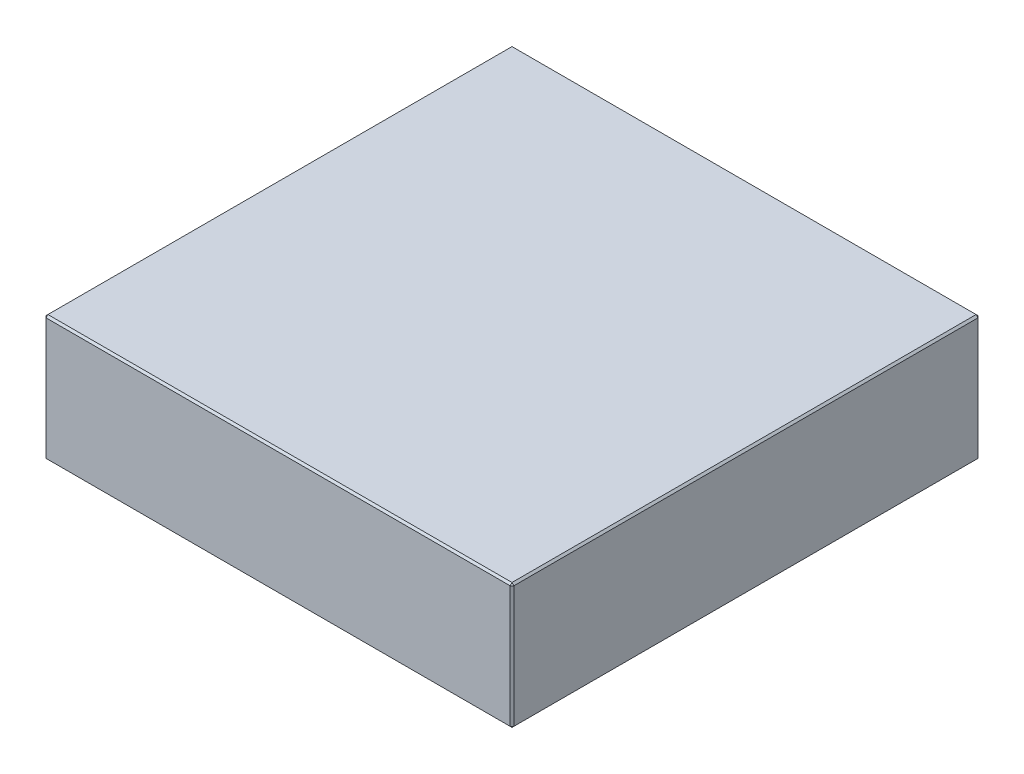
ISO-10303-21;
HEADER;
FILE_DESCRIPTION(('STEP AP214'),'2;1');
FILE_NAME('part.step','',(''),(''),'','','');
FILE_SCHEMA(('AUTOMOTIVE_DESIGN { 1 0 10303 214 1 1 1 1 }'));
ENDSEC;
DATA;
#1=APPLICATION_CONTEXT('core data for automotive mechanical design processes');
#2=APPLICATION_PROTOCOL_DEFINITION('international standard','automotive_design',2000,#1);
#3=PRODUCT_CONTEXT('',#1,'mechanical');
#4=PRODUCT('Part','Part','',(#3));
#5=PRODUCT_RELATED_PRODUCT_CATEGORY('part','',(#4));
#6=PRODUCT_DEFINITION_FORMATION('','',#4);
#7=PRODUCT_DEFINITION_CONTEXT('part definition',#1,'design');
#8=PRODUCT_DEFINITION('design','',#6,#7);
#9=PRODUCT_DEFINITION_SHAPE('','',#8);
#10=(LENGTH_UNIT() NAMED_UNIT(*) SI_UNIT(.MILLI.,.METRE.));
#11=(NAMED_UNIT(*) PLANE_ANGLE_UNIT() SI_UNIT($,.RADIAN.));
#12=(NAMED_UNIT(*) SI_UNIT($,.STERADIAN.) SOLID_ANGLE_UNIT());
#13=UNCERTAINTY_MEASURE_WITH_UNIT(LENGTH_MEASURE(1.E-05),#10,'distance_accuracy_value','');
#14=(GEOMETRIC_REPRESENTATION_CONTEXT(3) GLOBAL_UNCERTAINTY_ASSIGNED_CONTEXT((#13)) GLOBAL_UNIT_ASSIGNED_CONTEXT((#10,
#11,#12)) REPRESENTATION_CONTEXT('',''));
#15=CARTESIAN_POINT('',(0.,0.,0.));
#16=DIRECTION('',(0.,0.,1.));
#17=DIRECTION('',(1.,0.,0.));
#18=AXIS2_PLACEMENT_3D('',#15,#16,#17);
#19=CARTESIAN_POINT('',(-123.,66.,123.));
#20=DIRECTION('',(1.,0.,0.));
#21=DIRECTION('',(0.,0.,-1.));
#22=AXIS2_PLACEMENT_3D('',#19,#20,#21);
#23=PLANE('',#22);
#24=DIRECTION('',(0.,-1.,0.));
#25=VECTOR('',#24,1.);
#26=CARTESIAN_POINT('',(-123.,66.,-122.));
#27=LINE('',#26,#25);
#28=CARTESIAN_POINT('',(-123.,65.,-122.));
#29=VERTEX_POINT('',#28);
#30=CARTESIAN_POINT('',(-123.,1.,-122.));
#31=VERTEX_POINT('',#30);
#32=EDGE_CURVE('E115',#29,#31,#27,.T.);
#33=ORIENTED_EDGE('',*,*,#32,.T.);
#34=DIRECTION('',(0.,0.,1.));
#35=VECTOR('',#34,1.);
#36=CARTESIAN_POINT('',(-123.,1.,123.));
#37=LINE('',#36,#35);
#38=CARTESIAN_POINT('',(-123.,1.,122.));
#39=VERTEX_POINT('',#38);
#40=EDGE_CURVE('E111',#31,#39,#37,.T.);
#41=ORIENTED_EDGE('',*,*,#40,.T.);
#42=DIRECTION('',(0.,1.,0.));
#43=VECTOR('',#42,1.);
#44=CARTESIAN_POINT('',(-123.,66.,122.));
#45=LINE('',#44,#43);
#46=CARTESIAN_POINT('',(-123.,65.,122.));
#47=VERTEX_POINT('',#46);
#48=EDGE_CURVE('E104',#39,#47,#45,.T.);
#49=ORIENTED_EDGE('',*,*,#48,.T.);
#50=DIRECTION('',(0.,0.,-1.));
#51=VECTOR('',#50,1.);
#52=CARTESIAN_POINT('',(-123.,65.,-123.));
#53=LINE('',#52,#51);
#54=EDGE_CURVE('E108',#47,#29,#53,.T.);
#55=ORIENTED_EDGE('',*,*,#54,.T.);
#56=EDGE_LOOP('',(#33,#41,#49,#55));
#57=FACE_BOUND('',#56,.T.);
#58=ADVANCED_FACE('F16',(#57),#23,.F.);
#59=CARTESIAN_POINT('',(123.,66.,123.));
#60=DIRECTION('',(0.,0.,-1.));
#61=DIRECTION('',(-1.,0.,0.));
#62=AXIS2_PLACEMENT_3D('',#59,#60,#61);
#63=PLANE('',#62);
#64=DIRECTION('',(-1.,0.,0.));
#65=VECTOR('',#64,1.);
#66=CARTESIAN_POINT('',(-123.,65.,123.));
#67=LINE('',#66,#65);
#68=CARTESIAN_POINT('',(122.,65.,123.));
#69=VERTEX_POINT('',#68);
#70=CARTESIAN_POINT('',(-122.,65.,123.));
#71=VERTEX_POINT('',#70);
#72=EDGE_CURVE('E165',#69,#71,#67,.T.);
#73=ORIENTED_EDGE('',*,*,#72,.T.);
#74=DIRECTION('',(0.,-1.,0.));
#75=VECTOR('',#74,1.);
#76=CARTESIAN_POINT('',(-122.,66.,123.));
#77=LINE('',#76,#75);
#78=CARTESIAN_POINT('',(-122.,1.,123.));
#79=VERTEX_POINT('',#78);
#80=EDGE_CURVE('E123',#71,#79,#77,.T.);
#81=ORIENTED_EDGE('',*,*,#80,.T.);
#82=DIRECTION('',(1.,0.,0.));
#83=VECTOR('',#82,1.);
#84=CARTESIAN_POINT('',(123.,1.,123.));
#85=LINE('',#84,#83);
#86=CARTESIAN_POINT('',(122.,1.,123.));
#87=VERTEX_POINT('',#86);
#88=EDGE_CURVE('E169',#79,#87,#85,.T.);
#89=ORIENTED_EDGE('',*,*,#88,.T.);
#90=DIRECTION('',(0.,1.,0.));
#91=VECTOR('',#90,1.);
#92=CARTESIAN_POINT('',(122.,66.,123.));
#93=LINE('',#92,#91);
#94=EDGE_CURVE('E167',#87,#69,#93,.T.);
#95=ORIENTED_EDGE('',*,*,#94,.T.);
#96=EDGE_LOOP('',(#73,#81,#89,#95));
#97=FACE_BOUND('',#96,.T.);
#98=ADVANCED_FACE('F276',(#97),#63,.F.);
#99=CARTESIAN_POINT('',(123.,66.,123.));
#100=DIRECTION('',(-1.,0.,0.));
#101=DIRECTION('',(0.,0.,1.));
#102=AXIS2_PLACEMENT_3D('',#99,#100,#101);
#103=PLANE('',#102);
#104=DIRECTION('',(0.,0.,-1.));
#105=VECTOR('',#104,1.);
#106=CARTESIAN_POINT('',(123.,1.,123.));
#107=LINE('',#106,#105);
#108=CARTESIAN_POINT('',(123.,1.,122.));
#109=VERTEX_POINT('',#108);
#110=CARTESIAN_POINT('',(123.,1.,-122.));
#111=VERTEX_POINT('',#110);
#112=EDGE_CURVE('E160',#109,#111,#107,.T.);
#113=ORIENTED_EDGE('',*,*,#112,.T.);
#114=DIRECTION('',(0.,1.,0.));
#115=VECTOR('',#114,1.);
#116=CARTESIAN_POINT('',(123.,66.,-122.));
#117=LINE('',#116,#115);
#118=CARTESIAN_POINT('',(123.,65.,-122.));
#119=VERTEX_POINT('',#118);
#120=EDGE_CURVE('E162',#111,#119,#117,.T.);
#121=ORIENTED_EDGE('',*,*,#120,.T.);
#122=DIRECTION('',(0.,0.,1.));
#123=VECTOR('',#122,1.);
#124=CARTESIAN_POINT('',(123.,65.,123.));
#125=LINE('',#124,#123);
#126=CARTESIAN_POINT('',(123.,65.,122.));
#127=VERTEX_POINT('',#126);
#128=EDGE_CURVE('E156',#119,#127,#125,.T.);
#129=ORIENTED_EDGE('',*,*,#128,.T.);
#130=DIRECTION('',(0.,-1.,0.));
#131=VECTOR('',#130,1.);
#132=CARTESIAN_POINT('',(123.,66.,122.));
#133=LINE('',#132,#131);
#134=EDGE_CURVE('E158',#127,#109,#133,.T.);
#135=ORIENTED_EDGE('',*,*,#134,.T.);
#136=EDGE_LOOP('',(#113,#121,#129,#135));
#137=FACE_BOUND('',#136,.T.);
#138=ADVANCED_FACE('F255',(#137),#103,.F.);
#139=CARTESIAN_POINT('',(123.,66.,-123.));
#140=DIRECTION('',(0.,0.,1.));
#141=DIRECTION('',(1.,0.,0.));
#142=AXIS2_PLACEMENT_3D('',#139,#140,#141);
#143=PLANE('',#142);
#144=DIRECTION('',(0.,-1.,0.));
#145=VECTOR('',#144,1.);
#146=CARTESIAN_POINT('',(122.,66.,-123.));
#147=LINE('',#146,#145);
#148=CARTESIAN_POINT('',(122.,65.,-123.));
#149=VERTEX_POINT('',#148);
#150=CARTESIAN_POINT('',(122.,1.,-123.));
#151=VERTEX_POINT('',#150);
#152=EDGE_CURVE('E149',#149,#151,#147,.T.);
#153=ORIENTED_EDGE('',*,*,#152,.T.);
#154=DIRECTION('',(-1.,0.,0.));
#155=VECTOR('',#154,1.);
#156=CARTESIAN_POINT('',(123.,1.,-123.));
#157=LINE('',#156,#155);
#158=CARTESIAN_POINT('',(-122.,1.,-123.));
#159=VERTEX_POINT('',#158);
#160=EDGE_CURVE('E154',#151,#159,#157,.T.);
#161=ORIENTED_EDGE('',*,*,#160,.T.);
#162=DIRECTION('',(0.,1.,0.));
#163=VECTOR('',#162,1.);
#164=CARTESIAN_POINT('',(-122.,66.,-123.));
#165=LINE('',#164,#163);
#166=CARTESIAN_POINT('',(-122.,65.,-123.));
#167=VERTEX_POINT('',#166);
#168=EDGE_CURVE('E151',#159,#167,#165,.T.);
#169=ORIENTED_EDGE('',*,*,#168,.T.);
#170=DIRECTION('',(1.,0.,0.));
#171=VECTOR('',#170,1.);
#172=CARTESIAN_POINT('',(123.,65.,-123.));
#173=LINE('',#172,#171);
#174=EDGE_CURVE('E147',#167,#149,#173,.T.);
#175=ORIENTED_EDGE('',*,*,#174,.T.);
#176=EDGE_LOOP('',(#153,#161,#169,#175));
#177=FACE_BOUND('',#176,.T.);
#178=ADVANCED_FACE('F285',(#177),#143,.F.);
#179=CARTESIAN_POINT('',(0.,66.,0.));
#180=DIRECTION('',(0.,1.,0.));
#181=DIRECTION('',(0.,0.,1.));
#182=AXIS2_PLACEMENT_3D('',#179,#180,#181);
#183=PLANE('',#182);
#184=DIRECTION('',(0.,0.,-1.));
#185=VECTOR('',#184,1.);
#186=CARTESIAN_POINT('',(122.,66.,-123.));
#187=LINE('',#186,#185);
#188=CARTESIAN_POINT('',(122.,66.,122.));
#189=VERTEX_POINT('',#188);
#190=CARTESIAN_POINT('',(122.,66.,-122.));
#191=VERTEX_POINT('',#190);
#192=EDGE_CURVE('E25',#189,#191,#187,.T.);
#193=ORIENTED_EDGE('',*,*,#192,.T.);
#194=DIRECTION('',(-1.,0.,0.));
#195=VECTOR('',#194,1.);
#196=CARTESIAN_POINT('',(-123.,66.,-122.));
#197=LINE('',#196,#195);
#198=CARTESIAN_POINT('',(-122.,66.,-122.));
#199=VERTEX_POINT('',#198);
#200=EDGE_CURVE('E10',#191,#199,#197,.T.);
#201=ORIENTED_EDGE('',*,*,#200,.T.);
#202=DIRECTION('',(0.,0.,1.));
#203=VECTOR('',#202,1.);
#204=CARTESIAN_POINT('',(-122.,66.,123.));
#205=LINE('',#204,#203);
#206=CARTESIAN_POINT('',(-122.,66.,122.));
#207=VERTEX_POINT('',#206);
#208=EDGE_CURVE('E181',#199,#207,#205,.T.);
#209=ORIENTED_EDGE('',*,*,#208,.T.);
#210=DIRECTION('',(1.,0.,0.));
#211=VECTOR('',#210,1.);
#212=CARTESIAN_POINT('',(123.,66.,122.));
#213=LINE('',#212,#211);
#214=EDGE_CURVE('E36',#207,#189,#213,.T.);
#215=ORIENTED_EDGE('',*,*,#214,.T.);
#216=EDGE_LOOP('',(#193,#201,#209,#215));
#217=FACE_BOUND('',#216,.T.);
#218=ADVANCED_FACE('F351',(#217),#183,.T.);
#219=CARTESIAN_POINT('',(0.,0.,0.));
#220=DIRECTION('',(0.,1.,0.));
#221=DIRECTION('',(0.,0.,1.));
#222=AXIS2_PLACEMENT_3D('',#219,#220,#221);
#223=PLANE('',#222);
#224=DIRECTION('',(0.,0.,1.));
#225=VECTOR('',#224,1.);
#226=CARTESIAN_POINT('',(122.,0.,0.));
#227=LINE('',#226,#225);
#228=CARTESIAN_POINT('',(122.,0.,-122.));
#229=VERTEX_POINT('',#228);
#230=CARTESIAN_POINT('',(122.,0.,122.));
#231=VERTEX_POINT('',#230);
#232=EDGE_CURVE('E172',#229,#231,#227,.T.);
#233=ORIENTED_EDGE('',*,*,#232,.T.);
#234=DIRECTION('',(-1.,0.,0.));
#235=VECTOR('',#234,1.);
#236=CARTESIAN_POINT('',(0.,0.,122.));
#237=LINE('',#236,#235);
#238=CARTESIAN_POINT('',(-122.,0.,122.));
#239=VERTEX_POINT('',#238);
#240=EDGE_CURVE('E178',#231,#239,#237,.T.);
#241=ORIENTED_EDGE('',*,*,#240,.T.);
#242=DIRECTION('',(0.,0.,-1.));
#243=VECTOR('',#242,1.);
#244=CARTESIAN_POINT('',(-122.,0.,0.));
#245=LINE('',#244,#243);
#246=CARTESIAN_POINT('',(-122.,0.,-122.));
#247=VERTEX_POINT('',#246);
#248=EDGE_CURVE('E176',#239,#247,#245,.T.);
#249=ORIENTED_EDGE('',*,*,#248,.T.);
#250=DIRECTION('',(1.,0.,0.));
#251=VECTOR('',#250,1.);
#252=CARTESIAN_POINT('',(0.,0.,-122.));
#253=LINE('',#252,#251);
#254=EDGE_CURVE('E174',#247,#229,#253,.T.);
#255=ORIENTED_EDGE('',*,*,#254,.T.);
#256=EDGE_LOOP('',(#233,#241,#249,#255));
#257=FACE_BOUND('',#256,.T.);
#258=ADVANCED_FACE('F247',(#257),#223,.F.);
#259=CARTESIAN_POINT('',(123.,66.,122.));
#260=DIRECTION('',(-0.707106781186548,0.,-0.707106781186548));
#261=DIRECTION('',(0.,-1.,0.));
#262=AXIS2_PLACEMENT_3D('',#259,#260,#261);
#263=PLANE('',#262);
#264=DIRECTION('',(-0.707106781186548,0.,0.707106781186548));
#265=VECTOR('',#264,1.);
#266=CARTESIAN_POINT('',(122.,65.,123.));
#267=LINE('',#266,#265);
#268=EDGE_CURVE('E20',#69,#127,#267,.F.);
#269=ORIENTED_EDGE('',*,*,#268,.F.);
#270=ORIENTED_EDGE('',*,*,#94,.F.);
#271=DIRECTION('',(0.707106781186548,0.,-0.707106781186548));
#272=VECTOR('',#271,1.);
#273=CARTESIAN_POINT('',(122.,1.,123.));
#274=LINE('',#273,#272);
#275=EDGE_CURVE('E143',#109,#87,#274,.F.);
#276=ORIENTED_EDGE('',*,*,#275,.F.);
#277=ORIENTED_EDGE('',*,*,#134,.F.);
#278=EDGE_LOOP('',(#269,#270,#276,#277));
#279=FACE_BOUND('',#278,.T.);
#280=ADVANCED_FACE('F18',(#279),#263,.F.);
#281=CARTESIAN_POINT('',(122.,65.,123.));
#282=DIRECTION('',(0.577350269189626,0.577350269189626,0.577350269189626));
#283=DIRECTION('',(0.707106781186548,0.,-0.707106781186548));
#284=AXIS2_PLACEMENT_3D('',#281,#282,#283);
#285=PLANE('',#284);
#286=DIRECTION('',(0.,-0.707106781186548,0.707106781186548));
#287=VECTOR('',#286,1.);
#288=CARTESIAN_POINT('',(122.,65.,123.));
#289=LINE('',#288,#287);
#290=EDGE_CURVE('E227',#69,#189,#289,.F.);
#291=ORIENTED_EDGE('',*,*,#290,.F.);
#292=ORIENTED_EDGE('',*,*,#268,.T.);
#293=DIRECTION('',(-0.707106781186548,0.707106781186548,0.));
#294=VECTOR('',#293,1.);
#295=CARTESIAN_POINT('',(122.5,65.5,122.));
#296=LINE('',#295,#294);
#297=EDGE_CURVE('E229',#189,#127,#296,.F.);
#298=ORIENTED_EDGE('',*,*,#297,.F.);
#299=EDGE_LOOP('',(#291,#292,#298));
#300=FACE_BOUND('',#299,.T.);
#301=ADVANCED_FACE('F271',(#300),#285,.T.);
#302=CARTESIAN_POINT('',(122.,1.,123.));
#303=DIRECTION('',(0.577350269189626,-0.577350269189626,0.577350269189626));
#304=DIRECTION('',(0.707106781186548,0.,-0.707106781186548));
#305=AXIS2_PLACEMENT_3D('',#302,#303,#304);
#306=PLANE('',#305);
#307=DIRECTION('',(-0.707106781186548,-0.707106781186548,0.));
#308=VECTOR('',#307,1.);
#309=CARTESIAN_POINT('',(122.5,0.5,122.));
#310=LINE('',#309,#308);
#311=EDGE_CURVE('E221',#109,#231,#310,.T.);
#312=ORIENTED_EDGE('',*,*,#311,.F.);
#313=ORIENTED_EDGE('',*,*,#275,.T.);
#314=DIRECTION('',(0.,0.707106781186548,0.707106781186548));
#315=VECTOR('',#314,1.);
#316=CARTESIAN_POINT('',(122.,1.,123.));
#317=LINE('',#316,#315);
#318=EDGE_CURVE('E224',#231,#87,#317,.T.);
#319=ORIENTED_EDGE('',*,*,#318,.F.);
#320=EDGE_LOOP('',(#312,#313,#319));
#321=FACE_BOUND('',#320,.T.);
#322=ADVANCED_FACE('F236',(#321),#306,.T.);
#323=CARTESIAN_POINT('',(122.,66.,0.));
#324=DIRECTION('',(0.707106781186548,0.707106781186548,0.));
#325=DIRECTION('',(0.,0.,1.));
#326=AXIS2_PLACEMENT_3D('',#323,#324,#325);
#327=PLANE('',#326);
#328=ORIENTED_EDGE('',*,*,#297,.T.);
#329=ORIENTED_EDGE('',*,*,#128,.F.);
#330=DIRECTION('',(0.707106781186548,-0.707106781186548,0.));
#331=VECTOR('',#330,1.);
#332=CARTESIAN_POINT('',(123.,65.,-122.));
#333=LINE('',#332,#331);
#334=EDGE_CURVE('E216',#191,#119,#333,.T.);
#335=ORIENTED_EDGE('',*,*,#334,.F.);
#336=ORIENTED_EDGE('',*,*,#192,.F.);
#337=EDGE_LOOP('',(#328,#329,#335,#336));
#338=FACE_BOUND('',#337,.T.);
#339=ADVANCED_FACE('F266',(#338),#327,.T.);
#340=CARTESIAN_POINT('',(0.,66.,122.));
#341=DIRECTION('',(0.,0.707106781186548,0.707106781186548));
#342=DIRECTION('',(-1.,0.,0.));
#343=AXIS2_PLACEMENT_3D('',#340,#341,#342);
#344=PLANE('',#343);
#345=ORIENTED_EDGE('',*,*,#290,.T.);
#346=ORIENTED_EDGE('',*,*,#214,.F.);
#347=DIRECTION('',(0.,0.707106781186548,-0.707106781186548));
#348=VECTOR('',#347,1.);
#349=CARTESIAN_POINT('',(-122.,65.5,122.5));
#350=LINE('',#349,#348);
#351=EDGE_CURVE('E127',#71,#207,#350,.T.);
#352=ORIENTED_EDGE('',*,*,#351,.F.);
#353=ORIENTED_EDGE('',*,*,#72,.F.);
#354=EDGE_LOOP('',(#345,#346,#352,#353));
#355=FACE_BOUND('',#354,.T.);
#356=ADVANCED_FACE('F274',(#355),#344,.T.);
#357=CARTESIAN_POINT('',(-122.,66.,123.));
#358=DIRECTION('',(0.707106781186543,0.,-0.707106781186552));
#359=DIRECTION('',(0.,-1.,0.));
#360=AXIS2_PLACEMENT_3D('',#357,#358,#359);
#361=PLANE('',#360);
#362=DIRECTION('',(0.707106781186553,0.,0.707106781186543));
#363=VECTOR('',#362,1.);
#364=CARTESIAN_POINT('',(-122.,1.,123.));
#365=LINE('',#364,#363);
#366=EDGE_CURVE('E128',#79,#39,#365,.F.);
#367=ORIENTED_EDGE('',*,*,#366,.F.);
#368=ORIENTED_EDGE('',*,*,#80,.F.);
#369=DIRECTION('',(-0.707106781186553,0.,-0.707106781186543));
#370=VECTOR('',#369,1.);
#371=CARTESIAN_POINT('',(-123.,65.,122.));
#372=LINE('',#371,#370);
#373=EDGE_CURVE('E119',#47,#71,#372,.F.);
#374=ORIENTED_EDGE('',*,*,#373,.F.);
#375=ORIENTED_EDGE('',*,*,#48,.F.);
#376=EDGE_LOOP('',(#367,#368,#374,#375));
#377=FACE_BOUND('',#376,.T.);
#378=ADVANCED_FACE('F121',(#377),#361,.F.);
#379=CARTESIAN_POINT('',(123.,1.,123.));
#380=DIRECTION('',(0.,0.707106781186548,-0.707106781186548));
#381=DIRECTION('',(1.,0.,0.));
#382=AXIS2_PLACEMENT_3D('',#379,#380,#381);
#383=PLANE('',#382);
#384=ORIENTED_EDGE('',*,*,#318,.T.);
#385=ORIENTED_EDGE('',*,*,#88,.F.);
#386=DIRECTION('',(0.,-0.707106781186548,-0.707106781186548));
#387=VECTOR('',#386,1.);
#388=CARTESIAN_POINT('',(-122.,1.,123.));
#389=LINE('',#388,#387);
#390=EDGE_CURVE('E212',#239,#79,#389,.F.);
#391=ORIENTED_EDGE('',*,*,#390,.F.);
#392=ORIENTED_EDGE('',*,*,#240,.F.);
#393=EDGE_LOOP('',(#384,#385,#391,#392));
#394=FACE_BOUND('',#393,.T.);
#395=ADVANCED_FACE('F244',(#394),#383,.F.);
#396=CARTESIAN_POINT('',(123.,1.,123.));
#397=DIRECTION('',(-0.707106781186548,0.707106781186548,0.));
#398=DIRECTION('',(0.,0.,-1.));
#399=AXIS2_PLACEMENT_3D('',#396,#397,#398);
#400=PLANE('',#399);
#401=ORIENTED_EDGE('',*,*,#311,.T.);
#402=ORIENTED_EDGE('',*,*,#232,.F.);
#403=DIRECTION('',(0.707106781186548,0.707106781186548,0.));
#404=VECTOR('',#403,1.);
#405=CARTESIAN_POINT('',(122.5,0.500000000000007,-122.));
#406=LINE('',#405,#404);
#407=EDGE_CURVE('E209',#111,#229,#406,.F.);
#408=ORIENTED_EDGE('',*,*,#407,.F.);
#409=ORIENTED_EDGE('',*,*,#112,.F.);
#410=EDGE_LOOP('',(#401,#402,#408,#409));
#411=FACE_BOUND('',#410,.T.);
#412=ADVANCED_FACE('F252',(#411),#400,.F.);
#413=CARTESIAN_POINT('',(122.,66.,-123.));
#414=DIRECTION('',(-0.707106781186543,0.,0.707106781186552));
#415=DIRECTION('',(0.,-1.,0.));
#416=AXIS2_PLACEMENT_3D('',#413,#414,#415);
#417=PLANE('',#416);
#418=DIRECTION('',(0.707106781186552,0.,0.707106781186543));
#419=VECTOR('',#418,1.);
#420=CARTESIAN_POINT('',(123.,65.,-122.));
#421=LINE('',#420,#419);
#422=EDGE_CURVE('E218',#119,#149,#421,.F.);
#423=ORIENTED_EDGE('',*,*,#422,.F.);
#424=ORIENTED_EDGE('',*,*,#120,.F.);
#425=DIRECTION('',(-0.707106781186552,0.,-0.707106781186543));
#426=VECTOR('',#425,1.);
#427=CARTESIAN_POINT('',(122.,1.,-123.));
#428=LINE('',#427,#426);
#429=EDGE_CURVE('E206',#151,#111,#428,.F.);
#430=ORIENTED_EDGE('',*,*,#429,.F.);
#431=ORIENTED_EDGE('',*,*,#152,.F.);
#432=EDGE_LOOP('',(#423,#424,#430,#431));
#433=FACE_BOUND('',#432,.T.);
#434=ADVANCED_FACE('F259',(#433),#417,.F.);
#435=CARTESIAN_POINT('',(123.,65.,-122.));
#436=DIRECTION('',(0.57735026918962,0.577350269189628,-0.577350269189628));
#437=DIRECTION('',(0.,0.707106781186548,0.707106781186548));
#438=AXIS2_PLACEMENT_3D('',#435,#436,#437);
#439=PLANE('',#438);
#440=ORIENTED_EDGE('',*,*,#334,.T.);
#441=ORIENTED_EDGE('',*,*,#422,.T.);
#442=DIRECTION('',(0.,0.70710678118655,0.707106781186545));
#443=VECTOR('',#442,1.);
#444=CARTESIAN_POINT('',(122.,65.5,-122.5));
#445=LINE('',#444,#443);
#446=EDGE_CURVE('E135',#191,#149,#445,.F.);
#447=ORIENTED_EDGE('',*,*,#446,.F.);
#448=EDGE_LOOP('',(#440,#441,#447));
#449=FACE_BOUND('',#448,.T.);
#450=ADVANCED_FACE('F326',(#449),#439,.T.);
#451=CARTESIAN_POINT('',(-123.,65.,122.));
#452=DIRECTION('',(-0.577350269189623,0.577350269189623,0.577350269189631));
#453=DIRECTION('',(0.707106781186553,0.,0.707106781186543));
#454=AXIS2_PLACEMENT_3D('',#451,#452,#453);
#455=PLANE('',#454);
#456=ORIENTED_EDGE('',*,*,#373,.T.);
#457=ORIENTED_EDGE('',*,*,#351,.T.);
#458=DIRECTION('',(-0.707106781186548,-0.707106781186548,0.));
#459=VECTOR('',#458,1.);
#460=CARTESIAN_POINT('',(-123.,65.,122.));
#461=LINE('',#460,#459);
#462=EDGE_CURVE('E131',#47,#207,#461,.F.);
#463=ORIENTED_EDGE('',*,*,#462,.F.);
#464=EDGE_LOOP('',(#456,#457,#463));
#465=FACE_BOUND('',#464,.T.);
#466=ADVANCED_FACE('F132',(#465),#455,.T.);
#467=CARTESIAN_POINT('',(-122.,1.,123.));
#468=DIRECTION('',(-0.577350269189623,-0.577350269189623,0.577350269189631));
#469=DIRECTION('',(0.707106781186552,0.,0.707106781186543));
#470=AXIS2_PLACEMENT_3D('',#467,#468,#469);
#471=PLANE('',#470);
#472=ORIENTED_EDGE('',*,*,#390,.T.);
#473=ORIENTED_EDGE('',*,*,#366,.T.);
#474=DIRECTION('',(-0.707106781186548,0.707106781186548,0.));
#475=VECTOR('',#474,1.);
#476=CARTESIAN_POINT('',(-122.5,0.499999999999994,122.));
#477=LINE('',#476,#475);
#478=EDGE_CURVE('E136',#239,#39,#477,.T.);
#479=ORIENTED_EDGE('',*,*,#478,.F.);
#480=EDGE_LOOP('',(#472,#473,#479));
#481=FACE_BOUND('',#480,.T.);
#482=ADVANCED_FACE('F319',(#481),#471,.T.);
#483=CARTESIAN_POINT('',(122.,1.,-123.));
#484=DIRECTION('',(0.57735026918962,-0.577350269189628,-0.577350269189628));
#485=DIRECTION('',(0.,0.707106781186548,-0.707106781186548));
#486=AXIS2_PLACEMENT_3D('',#483,#484,#485);
#487=PLANE('',#486);
#488=ORIENTED_EDGE('',*,*,#429,.T.);
#489=ORIENTED_EDGE('',*,*,#407,.T.);
#490=DIRECTION('',(0.,-0.70710678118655,0.707106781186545));
#491=VECTOR('',#490,1.);
#492=CARTESIAN_POINT('',(122.,1.,-123.));
#493=LINE('',#492,#491);
#494=EDGE_CURVE('E199',#151,#229,#493,.T.);
#495=ORIENTED_EDGE('',*,*,#494,.F.);
#496=EDGE_LOOP('',(#488,#489,#495));
#497=FACE_BOUND('',#496,.T.);
#498=ADVANCED_FACE('F315',(#497),#487,.T.);
#499=CARTESIAN_POINT('',(0.,66.,-122.));
#500=DIRECTION('',(0.,0.707106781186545,-0.70710678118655));
#501=DIRECTION('',(1.,0.,0.));
#502=AXIS2_PLACEMENT_3D('',#499,#500,#501);
#503=PLANE('',#502);
#504=ORIENTED_EDGE('',*,*,#446,.T.);
#505=ORIENTED_EDGE('',*,*,#174,.F.);
#506=DIRECTION('',(0.,-0.70710678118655,-0.707106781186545));
#507=VECTOR('',#506,1.);
#508=CARTESIAN_POINT('',(-122.,65.,-123.));
#509=LINE('',#508,#507);
#510=EDGE_CURVE('E196',#199,#167,#509,.T.);
#511=ORIENTED_EDGE('',*,*,#510,.F.);
#512=ORIENTED_EDGE('',*,*,#200,.F.);
#513=EDGE_LOOP('',(#504,#505,#511,#512));
#514=FACE_BOUND('',#513,.T.);
#515=ADVANCED_FACE('F312',(#514),#503,.T.);
#516=CARTESIAN_POINT('',(-122.,66.,0.));
#517=DIRECTION('',(-0.707106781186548,0.707106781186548,0.));
#518=DIRECTION('',(0.,0.,-1.));
#519=AXIS2_PLACEMENT_3D('',#516,#517,#518);
#520=PLANE('',#519);
#521=ORIENTED_EDGE('',*,*,#462,.T.);
#522=ORIENTED_EDGE('',*,*,#208,.F.);
#523=DIRECTION('',(0.707106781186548,0.707106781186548,0.));
#524=VECTOR('',#523,1.);
#525=CARTESIAN_POINT('',(-122.5,65.5,-122.));
#526=LINE('',#525,#524);
#527=EDGE_CURVE('E139',#29,#199,#526,.T.);
#528=ORIENTED_EDGE('',*,*,#527,.F.);
#529=ORIENTED_EDGE('',*,*,#54,.F.);
#530=EDGE_LOOP('',(#521,#522,#528,#529));
#531=FACE_BOUND('',#530,.T.);
#532=ADVANCED_FACE('F138',(#531),#520,.T.);
#533=CARTESIAN_POINT('',(-123.,1.,123.));
#534=DIRECTION('',(0.707106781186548,0.707106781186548,0.));
#535=DIRECTION('',(0.,0.,1.));
#536=AXIS2_PLACEMENT_3D('',#533,#534,#535);
#537=PLANE('',#536);
#538=ORIENTED_EDGE('',*,*,#478,.T.);
#539=ORIENTED_EDGE('',*,*,#40,.F.);
#540=DIRECTION('',(0.707106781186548,-0.707106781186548,0.));
#541=VECTOR('',#540,1.);
#542=CARTESIAN_POINT('',(-123.,1.,-122.));
#543=LINE('',#542,#541);
#544=EDGE_CURVE('E192',#247,#31,#543,.F.);
#545=ORIENTED_EDGE('',*,*,#544,.F.);
#546=ORIENTED_EDGE('',*,*,#248,.F.);
#547=EDGE_LOOP('',(#538,#539,#545,#546));
#548=FACE_BOUND('',#547,.T.);
#549=ADVANCED_FACE('F305',(#548),#537,.F.);
#550=CARTESIAN_POINT('',(123.,1.,-123.));
#551=DIRECTION('',(0.,0.707106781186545,0.70710678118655));
#552=DIRECTION('',(-1.,0.,0.));
#553=AXIS2_PLACEMENT_3D('',#550,#551,#552);
#554=PLANE('',#553);
#555=ORIENTED_EDGE('',*,*,#494,.T.);
#556=ORIENTED_EDGE('',*,*,#254,.F.);
#557=DIRECTION('',(0.,0.70710678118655,-0.707106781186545));
#558=VECTOR('',#557,1.);
#559=CARTESIAN_POINT('',(-122.,0.5,-122.5));
#560=LINE('',#559,#558);
#561=EDGE_CURVE('E189',#159,#247,#560,.F.);
#562=ORIENTED_EDGE('',*,*,#561,.F.);
#563=ORIENTED_EDGE('',*,*,#160,.F.);
#564=EDGE_LOOP('',(#555,#556,#562,#563));
#565=FACE_BOUND('',#564,.T.);
#566=ADVANCED_FACE('F301',(#565),#554,.F.);
#567=CARTESIAN_POINT('',(-122.,65.,-123.));
#568=DIRECTION('',(-0.577350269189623,0.577350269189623,-0.577350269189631));
#569=DIRECTION('',(-0.707106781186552,0.,0.707106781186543));
#570=AXIS2_PLACEMENT_3D('',#567,#568,#569);
#571=PLANE('',#570);
#572=ORIENTED_EDGE('',*,*,#527,.T.);
#573=ORIENTED_EDGE('',*,*,#510,.T.);
#574=DIRECTION('',(0.707106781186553,0.,-0.707106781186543));
#575=VECTOR('',#574,1.);
#576=CARTESIAN_POINT('',(-122.,65.,-123.));
#577=LINE('',#576,#575);
#578=EDGE_CURVE('E187',#29,#167,#577,.T.);
#579=ORIENTED_EDGE('',*,*,#578,.F.);
#580=EDGE_LOOP('',(#572,#573,#579));
#581=FACE_BOUND('',#580,.T.);
#582=ADVANCED_FACE('F297',(#581),#571,.T.);
#583=CARTESIAN_POINT('',(-123.,1.,-122.));
#584=DIRECTION('',(-0.577350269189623,-0.577350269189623,-0.577350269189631));
#585=DIRECTION('',(-0.707106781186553,0.,0.707106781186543));
#586=AXIS2_PLACEMENT_3D('',#583,#584,#585);
#587=PLANE('',#586);
#588=ORIENTED_EDGE('',*,*,#561,.T.);
#589=ORIENTED_EDGE('',*,*,#544,.T.);
#590=DIRECTION('',(-0.707106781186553,0.,0.707106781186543));
#591=VECTOR('',#590,1.);
#592=CARTESIAN_POINT('',(-123.,1.,-122.));
#593=LINE('',#592,#591);
#594=EDGE_CURVE('E185',#159,#31,#593,.T.);
#595=ORIENTED_EDGE('',*,*,#594,.F.);
#596=EDGE_LOOP('',(#588,#589,#595));
#597=FACE_BOUND('',#596,.T.);
#598=ADVANCED_FACE('F293',(#597),#587,.T.);
#599=CARTESIAN_POINT('',(-123.,66.,-122.));
#600=DIRECTION('',(0.707106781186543,0.,0.707106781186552));
#601=DIRECTION('',(0.,-1.,0.));
#602=AXIS2_PLACEMENT_3D('',#599,#600,#601);
#603=PLANE('',#602);
#604=ORIENTED_EDGE('',*,*,#578,.T.);
#605=ORIENTED_EDGE('',*,*,#168,.F.);
#606=ORIENTED_EDGE('',*,*,#594,.T.);
#607=ORIENTED_EDGE('',*,*,#32,.F.);
#608=EDGE_LOOP('',(#604,#605,#606,#607));
#609=FACE_BOUND('',#608,.T.);
#610=ADVANCED_FACE('F290',(#609),#603,.F.);
#611=CLOSED_SHELL('',(#58,#98,#138,#178,#218,#258,#280,#301,#322,#339,#356,#378,#395,#412,#434,
#450,#466,#482,#498,#515,#532,#549,#566,#582,#598,#610));
#612=MANIFOLD_SOLID_BREP('B1',#611);
#613=ADVANCED_BREP_SHAPE_REPRESENTATION('',(#18,#612),#14);
#614=SHAPE_DEFINITION_REPRESENTATION(#9,#613);
ENDSEC;
END-ISO-10303-21;
